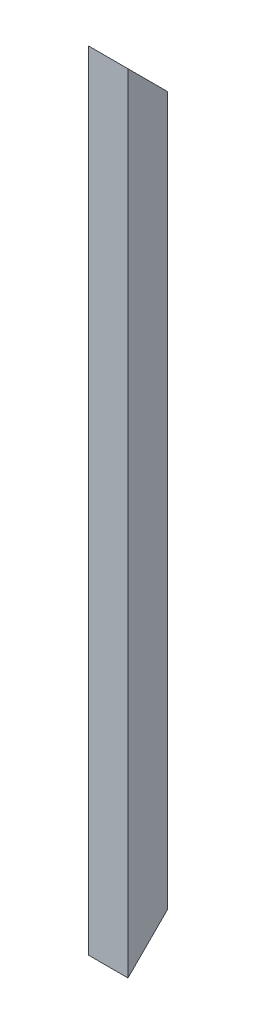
ISO-10303-21;
HEADER;
FILE_DESCRIPTION(('STEP AP214'),'2;1');
FILE_NAME('part.step','',(''),(''),'','','');
FILE_SCHEMA(('AUTOMOTIVE_DESIGN { 1 0 10303 214 1 1 1 1 }'));
ENDSEC;
DATA;
#1=APPLICATION_CONTEXT('core data for automotive mechanical design processes');
#2=APPLICATION_PROTOCOL_DEFINITION('international standard','automotive_design',2000,#1);
#3=PRODUCT_CONTEXT('',#1,'mechanical');
#4=PRODUCT('Part','Part','',(#3));
#5=PRODUCT_RELATED_PRODUCT_CATEGORY('part','',(#4));
#6=PRODUCT_DEFINITION_FORMATION('','',#4);
#7=PRODUCT_DEFINITION_CONTEXT('part definition',#1,'design');
#8=PRODUCT_DEFINITION('design','',#6,#7);
#9=PRODUCT_DEFINITION_SHAPE('','',#8);
#10=(LENGTH_UNIT() NAMED_UNIT(*) SI_UNIT(.MILLI.,.METRE.));
#11=(NAMED_UNIT(*) PLANE_ANGLE_UNIT() SI_UNIT($,.RADIAN.));
#12=(NAMED_UNIT(*) SI_UNIT($,.STERADIAN.) SOLID_ANGLE_UNIT());
#13=UNCERTAINTY_MEASURE_WITH_UNIT(LENGTH_MEASURE(1.E-05),#10,'distance_accuracy_value','');
#14=(GEOMETRIC_REPRESENTATION_CONTEXT(3) GLOBAL_UNCERTAINTY_ASSIGNED_CONTEXT((#13)) GLOBAL_UNIT_ASSIGNED_CONTEXT((#10,
#11,#12)) REPRESENTATION_CONTEXT('',''));
#15=CARTESIAN_POINT('',(0.,0.,0.));
#16=DIRECTION('',(0.,0.,1.));
#17=DIRECTION('',(1.,0.,0.));
#18=AXIS2_PLACEMENT_3D('',#15,#16,#17);
#19=CARTESIAN_POINT('',(-9.525,508.,9.52499999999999));
#20=DIRECTION('',(0.,0.,-1.));
#21=DIRECTION('',(-1.,0.,0.));
#22=AXIS2_PLACEMENT_3D('',#19,#20,#21);
#23=PLANE('',#22);
#24=DIRECTION('',(0.,-1.,0.));
#25=VECTOR('',#24,1.);
#26=CARTESIAN_POINT('',(9.525,508.,9.52499999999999));
#27=LINE('',#26,#25);
#28=CARTESIAN_POINT('',(9.525,504.825,9.52499999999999));
#29=VERTEX_POINT('',#28);
#30=CARTESIAN_POINT('',(9.525,3.17500000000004,9.52499999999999));
#31=VERTEX_POINT('',#30);
#32=EDGE_CURVE('E132',#29,#31,#27,.T.);
#33=ORIENTED_EDGE('',*,*,#32,.T.);
#34=DIRECTION('',(-1.,0.,0.));
#35=VECTOR('',#34,1.);
#36=CARTESIAN_POINT('',(-9.525,3.17500000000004,9.52499999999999));
#37=LINE('',#36,#35);
#38=CARTESIAN_POINT('',(-9.525,3.17500000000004,9.52499999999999));
#39=VERTEX_POINT('',#38);
#40=EDGE_CURVE('E12',#31,#39,#37,.T.);
#41=ORIENTED_EDGE('',*,*,#40,.T.);
#42=DIRECTION('',(0.,-1.,0.));
#43=VECTOR('',#42,1.);
#44=CARTESIAN_POINT('',(-9.525,508.,9.52499999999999));
#45=LINE('',#44,#43);
#46=CARTESIAN_POINT('',(-9.525,504.825,9.52499999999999));
#47=VERTEX_POINT('',#46);
#48=EDGE_CURVE('E134',#47,#39,#45,.T.);
#49=ORIENTED_EDGE('',*,*,#48,.F.);
#50=DIRECTION('',(1.,0.,0.));
#51=VECTOR('',#50,1.);
#52=CARTESIAN_POINT('',(-9.525,504.825,9.52499999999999));
#53=LINE('',#52,#51);
#54=EDGE_CURVE('E40',#47,#29,#53,.T.);
#55=ORIENTED_EDGE('',*,*,#54,.T.);
#56=EDGE_LOOP('',(#33,#41,#49,#55));
#57=FACE_BOUND('',#56,.T.);
#58=ADVANCED_FACE('F32',(#57),#23,.T.);
#59=CARTESIAN_POINT('',(-9.525,508.,9.52499999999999));
#60=DIRECTION('',(1.,0.,0.));
#61=DIRECTION('',(0.,0.,-1.));
#62=AXIS2_PLACEMENT_3D('',#59,#60,#61);
#63=PLANE('',#62);
#64=ORIENTED_EDGE('',*,*,#48,.T.);
#65=DIRECTION('',(0.,0.707106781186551,-0.707106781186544));
#66=VECTOR('',#65,1.);
#67=CARTESIAN_POINT('',(-9.525,255.587500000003,-242.8875));
#68=LINE('',#67,#66);
#69=CARTESIAN_POINT('',(-9.525,22.2250000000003,-9.52500000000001));
#70=VERTEX_POINT('',#69);
#71=EDGE_CURVE('E55',#39,#70,#68,.T.);
#72=ORIENTED_EDGE('',*,*,#71,.T.);
#73=DIRECTION('',(0.,-1.,0.));
#74=VECTOR('',#73,1.);
#75=CARTESIAN_POINT('',(-9.525,508.,-9.525));
#76=LINE('',#75,#74);
#77=CARTESIAN_POINT('',(-9.525,485.775,-9.525));
#78=VERTEX_POINT('',#77);
#79=EDGE_CURVE('E143',#78,#70,#76,.T.);
#80=ORIENTED_EDGE('',*,*,#79,.F.);
#81=DIRECTION('',(0.,0.707106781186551,0.707106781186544));
#82=VECTOR('',#81,1.);
#83=CARTESIAN_POINT('',(-9.525,506.4125,11.1125));
#84=LINE('',#83,#82);
#85=EDGE_CURVE('E162',#78,#47,#84,.T.);
#86=ORIENTED_EDGE('',*,*,#85,.T.);
#87=EDGE_LOOP('',(#64,#72,#80,#86));
#88=FACE_BOUND('',#87,.T.);
#89=ADVANCED_FACE('F187',(#88),#63,.T.);
#90=CARTESIAN_POINT('',(-9.525,508.,-9.525));
#91=DIRECTION('',(0.,0.,1.));
#92=DIRECTION('',(1.,0.,0.));
#93=AXIS2_PLACEMENT_3D('',#90,#91,#92);
#94=PLANE('',#93);
#95=ORIENTED_EDGE('',*,*,#79,.T.);
#96=DIRECTION('',(1.,0.,0.));
#97=VECTOR('',#96,1.);
#98=CARTESIAN_POINT('',(-9.525,22.2250000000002,-9.525));
#99=LINE('',#98,#97);
#100=CARTESIAN_POINT('',(9.525,22.2250000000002,-9.525));
#101=VERTEX_POINT('',#100);
#102=EDGE_CURVE('E145',#70,#101,#99,.T.);
#103=ORIENTED_EDGE('',*,*,#102,.T.);
#104=DIRECTION('',(0.,-1.,0.));
#105=VECTOR('',#104,1.);
#106=CARTESIAN_POINT('',(9.525,508.,-9.525));
#107=LINE('',#106,#105);
#108=CARTESIAN_POINT('',(9.525,485.775,-9.525));
#109=VERTEX_POINT('',#108);
#110=EDGE_CURVE('E151',#109,#101,#107,.T.);
#111=ORIENTED_EDGE('',*,*,#110,.F.);
#112=DIRECTION('',(-1.,0.,0.));
#113=VECTOR('',#112,1.);
#114=CARTESIAN_POINT('',(-9.525,485.775,-9.525));
#115=LINE('',#114,#113);
#116=EDGE_CURVE('E156',#109,#78,#115,.T.);
#117=ORIENTED_EDGE('',*,*,#116,.T.);
#118=EDGE_LOOP('',(#95,#103,#111,#117));
#119=FACE_BOUND('',#118,.T.);
#120=ADVANCED_FACE('F155',(#119),#94,.T.);
#121=CARTESIAN_POINT('',(9.525,508.,9.52499999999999));
#122=DIRECTION('',(-1.,0.,0.));
#123=DIRECTION('',(0.,0.,1.));
#124=AXIS2_PLACEMENT_3D('',#121,#122,#123);
#125=PLANE('',#124);
#126=ORIENTED_EDGE('',*,*,#110,.T.);
#127=DIRECTION('',(0.,-0.707106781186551,0.707106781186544));
#128=VECTOR('',#127,1.);
#129=CARTESIAN_POINT('',(9.525,255.587500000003,-242.8875));
#130=LINE('',#129,#128);
#131=EDGE_CURVE('E141',#101,#31,#130,.T.);
#132=ORIENTED_EDGE('',*,*,#131,.T.);
#133=ORIENTED_EDGE('',*,*,#32,.F.);
#134=DIRECTION('',(0.,-0.707106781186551,-0.707106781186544));
#135=VECTOR('',#134,1.);
#136=CARTESIAN_POINT('',(9.525,506.4125,11.1125));
#137=LINE('',#136,#135);
#138=EDGE_CURVE('E47',#29,#109,#137,.T.);
#139=ORIENTED_EDGE('',*,*,#138,.T.);
#140=EDGE_LOOP('',(#126,#132,#133,#139));
#141=FACE_BOUND('',#140,.T.);
#142=ADVANCED_FACE('F139',(#141),#125,.T.);
#143=CARTESIAN_POINT('',(12.7,508.,12.7));
#144=DIRECTION('',(0.,0.707106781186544,-0.707106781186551));
#145=DIRECTION('',(0.,0.707106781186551,0.707106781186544));
#146=AXIS2_PLACEMENT_3D('',#143,#144,#145);
#147=PLANE('',#146);
#148=ORIENTED_EDGE('',*,*,#54,.F.);
#149=ORIENTED_EDGE('',*,*,#85,.F.);
#150=ORIENTED_EDGE('',*,*,#116,.F.);
#151=ORIENTED_EDGE('',*,*,#138,.F.);
#152=EDGE_LOOP('',(#148,#149,#150,#151));
#153=FACE_BOUND('',#152,.T.);
#154=DIRECTION('',(0.,-0.707106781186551,-0.707106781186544));
#155=VECTOR('',#154,1.);
#156=CARTESIAN_POINT('',(-12.7,508.,12.7));
#157=LINE('',#156,#155);
#158=CARTESIAN_POINT('',(-12.7,508.,12.7));
#159=VERTEX_POINT('',#158);
#160=CARTESIAN_POINT('',(-12.7,482.6,-12.7));
#161=VERTEX_POINT('',#160);
#162=EDGE_CURVE('E101',#159,#161,#157,.T.);
#163=ORIENTED_EDGE('',*,*,#162,.F.);
#164=DIRECTION('',(1.,0.,0.));
#165=VECTOR('',#164,1.);
#166=CARTESIAN_POINT('',(-12.7,508.,12.7));
#167=LINE('',#166,#165);
#168=CARTESIAN_POINT('',(12.7,508.,12.7));
#169=VERTEX_POINT('',#168);
#170=EDGE_CURVE('E95',#159,#169,#167,.T.);
#171=ORIENTED_EDGE('',*,*,#170,.T.);
#172=DIRECTION('',(0.,-0.707106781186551,-0.707106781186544));
#173=VECTOR('',#172,1.);
#174=CARTESIAN_POINT('',(12.7,508.,12.7));
#175=LINE('',#174,#173);
#176=CARTESIAN_POINT('',(12.7,482.6,-12.6999999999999));
#177=VERTEX_POINT('',#176);
#178=EDGE_CURVE('E98',#169,#177,#175,.T.);
#179=ORIENTED_EDGE('',*,*,#178,.T.);
#180=DIRECTION('',(-1.,0.,0.));
#181=VECTOR('',#180,1.);
#182=CARTESIAN_POINT('',(12.7,482.6,-12.7));
#183=LINE('',#182,#181);
#184=EDGE_CURVE('E165',#177,#161,#183,.T.);
#185=ORIENTED_EDGE('',*,*,#184,.T.);
#186=EDGE_LOOP('',(#163,#171,#179,#185));
#187=FACE_BOUND('',#186,.T.);
#188=ADVANCED_FACE('F97',(#153,#187),#147,.T.);
#189=CARTESIAN_POINT('',(12.7,25.4000000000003,-12.7));
#190=DIRECTION('',(0.,-0.707106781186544,-0.707106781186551));
#191=DIRECTION('',(0.,0.707106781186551,-0.707106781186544));
#192=AXIS2_PLACEMENT_3D('',#189,#190,#191);
#193=PLANE('',#192);
#194=ORIENTED_EDGE('',*,*,#102,.F.);
#195=ORIENTED_EDGE('',*,*,#71,.F.);
#196=ORIENTED_EDGE('',*,*,#40,.F.);
#197=ORIENTED_EDGE('',*,*,#131,.F.);
#198=EDGE_LOOP('',(#194,#195,#196,#197));
#199=FACE_BOUND('',#198,.T.);
#200=DIRECTION('',(0.,-0.707106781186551,0.707106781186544));
#201=VECTOR('',#200,1.);
#202=CARTESIAN_POINT('',(-12.7,25.4000000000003,-12.7));
#203=LINE('',#202,#201);
#204=CARTESIAN_POINT('',(-12.7,25.4000000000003,-12.7));
#205=VERTEX_POINT('',#204);
#206=CARTESIAN_POINT('',(-12.7,0.,12.7));
#207=VERTEX_POINT('',#206);
#208=EDGE_CURVE('E116',#205,#207,#203,.T.);
#209=ORIENTED_EDGE('',*,*,#208,.F.);
#210=DIRECTION('',(-1.,0.,0.));
#211=VECTOR('',#210,1.);
#212=CARTESIAN_POINT('',(12.7,25.4000000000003,-12.7));
#213=LINE('',#212,#211);
#214=CARTESIAN_POINT('',(12.7,25.4000000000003,-12.7));
#215=VERTEX_POINT('',#214);
#216=EDGE_CURVE('E164',#215,#205,#213,.T.);
#217=ORIENTED_EDGE('',*,*,#216,.F.);
#218=DIRECTION('',(0.,-0.707106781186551,0.707106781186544));
#219=VECTOR('',#218,1.);
#220=CARTESIAN_POINT('',(12.7,25.4000000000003,-12.7));
#221=LINE('',#220,#219);
#222=CARTESIAN_POINT('',(12.7,0.,12.7));
#223=VERTEX_POINT('',#222);
#224=EDGE_CURVE('E115',#215,#223,#221,.T.);
#225=ORIENTED_EDGE('',*,*,#224,.T.);
#226=DIRECTION('',(1.,0.,0.));
#227=VECTOR('',#226,1.);
#228=CARTESIAN_POINT('',(-12.7,0.,12.7));
#229=LINE('',#228,#227);
#230=EDGE_CURVE('E107',#207,#223,#229,.T.);
#231=ORIENTED_EDGE('',*,*,#230,.F.);
#232=EDGE_LOOP('',(#209,#217,#225,#231));
#233=FACE_BOUND('',#232,.T.);
#234=ADVANCED_FACE('F173',(#199,#233),#193,.T.);
#235=CARTESIAN_POINT('',(12.7,508.,12.7));
#236=DIRECTION('',(-1.,0.,0.));
#237=DIRECTION('',(0.,0.,1.));
#238=AXIS2_PLACEMENT_3D('',#235,#236,#237);
#239=PLANE('',#238);
#240=ORIENTED_EDGE('',*,*,#224,.F.);
#241=DIRECTION('',(0.,-1.,0.));
#242=VECTOR('',#241,1.);
#243=CARTESIAN_POINT('',(12.7,508.,-12.7));
#244=LINE('',#243,#242);
#245=EDGE_CURVE('E114',#177,#215,#244,.T.);
#246=ORIENTED_EDGE('',*,*,#245,.F.);
#247=ORIENTED_EDGE('',*,*,#178,.F.);
#248=DIRECTION('',(0.,-1.,0.));
#249=VECTOR('',#248,1.);
#250=CARTESIAN_POINT('',(12.7,508.,12.7));
#251=LINE('',#250,#249);
#252=EDGE_CURVE('E106',#169,#223,#251,.T.);
#253=ORIENTED_EDGE('',*,*,#252,.T.);
#254=EDGE_LOOP('',(#240,#246,#247,#253));
#255=FACE_BOUND('',#254,.T.);
#256=ADVANCED_FACE('F34',(#255),#239,.F.);
#257=CARTESIAN_POINT('',(-12.7,508.,-12.7));
#258=DIRECTION('',(0.,0.,1.));
#259=DIRECTION('',(1.,0.,0.));
#260=AXIS2_PLACEMENT_3D('',#257,#258,#259);
#261=PLANE('',#260);
#262=ORIENTED_EDGE('',*,*,#216,.T.);
#263=DIRECTION('',(0.,-1.,0.));
#264=VECTOR('',#263,1.);
#265=CARTESIAN_POINT('',(-12.7,508.,-12.7));
#266=LINE('',#265,#264);
#267=EDGE_CURVE('E122',#161,#205,#266,.T.);
#268=ORIENTED_EDGE('',*,*,#267,.F.);
#269=ORIENTED_EDGE('',*,*,#184,.F.);
#270=ORIENTED_EDGE('',*,*,#245,.T.);
#271=EDGE_LOOP('',(#262,#268,#269,#270));
#272=FACE_BOUND('',#271,.T.);
#273=ADVANCED_FACE('F175',(#272),#261,.F.);
#274=CARTESIAN_POINT('',(-12.7,508.,12.7));
#275=DIRECTION('',(1.,0.,0.));
#276=DIRECTION('',(0.,0.,-1.));
#277=AXIS2_PLACEMENT_3D('',#274,#275,#276);
#278=PLANE('',#277);
#279=ORIENTED_EDGE('',*,*,#208,.T.);
#280=DIRECTION('',(0.,-1.,0.));
#281=VECTOR('',#280,1.);
#282=CARTESIAN_POINT('',(-12.7,508.,12.7));
#283=LINE('',#282,#281);
#284=EDGE_CURVE('E120',#159,#207,#283,.T.);
#285=ORIENTED_EDGE('',*,*,#284,.F.);
#286=ORIENTED_EDGE('',*,*,#162,.T.);
#287=ORIENTED_EDGE('',*,*,#267,.T.);
#288=EDGE_LOOP('',(#279,#285,#286,#287));
#289=FACE_BOUND('',#288,.T.);
#290=ADVANCED_FACE('F178',(#289),#278,.F.);
#291=CARTESIAN_POINT('',(-12.7,508.,12.7));
#292=DIRECTION('',(0.,0.,-1.));
#293=DIRECTION('',(-1.,0.,0.));
#294=AXIS2_PLACEMENT_3D('',#291,#292,#293);
#295=PLANE('',#294);
#296=ORIENTED_EDGE('',*,*,#230,.T.);
#297=ORIENTED_EDGE('',*,*,#252,.F.);
#298=ORIENTED_EDGE('',*,*,#170,.F.);
#299=ORIENTED_EDGE('',*,*,#284,.T.);
#300=EDGE_LOOP('',(#296,#297,#298,#299));
#301=FACE_BOUND('',#300,.T.);
#302=ADVANCED_FACE('F119',(#301),#295,.F.);
#303=CLOSED_SHELL('',(#58,#89,#120,#142,#188,#234,#256,#273,#290,#302));
#304=MANIFOLD_SOLID_BREP('B2',#303);
#305=ADVANCED_BREP_SHAPE_REPRESENTATION('',(#18,#304),#14);
#306=SHAPE_DEFINITION_REPRESENTATION(#9,#305);
ENDSEC;
END-ISO-10303-21;
